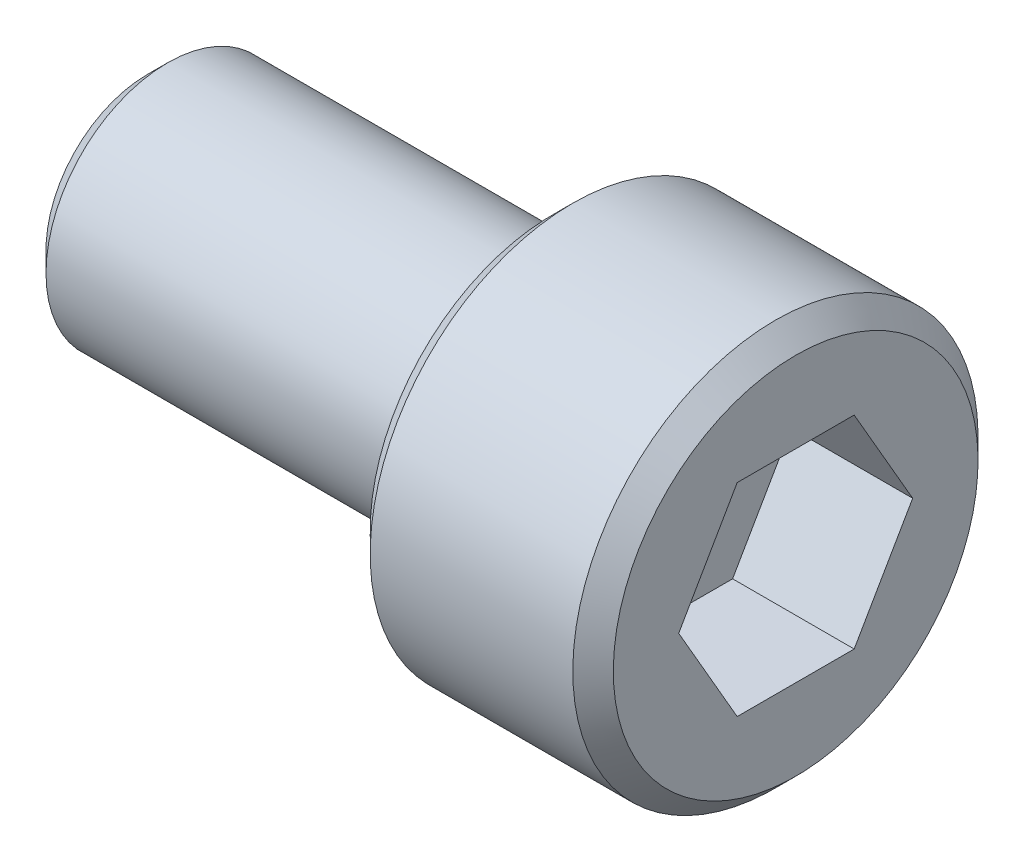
from build123d import *

# Parameters (mm, degrees)
ENL_V_MAT_EXTRU_1_DEPTH = 3
CHANFREIN2_SIZE         = 0.5


with BuildPart() as part:
    # Esquisse1 → R_volution1 (revolve)
    with BuildSketch(Plane.XY):
        Polygon((-16, 0), (-16, 3), (-6, 3), (-6, 5), (0, 5), (0, 0), align=None)
    revolve(axis=Axis((0, 0, 0), (-1, 0, 0)))

    # Esquisse2 → Enl_v. mat.-Extru.1 (cut)
    with BuildSketch(Plane(origin=(0, 0, 0), x_dir=(0, 0, -1), z_dir=(1, 0, 0))):
        Polygon((2.886751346, 0), (1.443375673, 2.5), (-1.443375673, 2.5), (-2.886751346, 0), (-1.443375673, -2.5), (1.443375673, -2.5), align=None)
    extrude(amount=-ENL_V_MAT_EXTRU_1_DEPTH, mode=Mode.SUBTRACT)

    # Chanfrein2
    chanfrein2_edges = [part.edges().sort_by_distance(p)[0] for p in [
        (0, -5, 0),
        (-6, -5, 0),
        (-16, -3, 0),
    ]]
    chamfer(chanfrein2_edges, length=CHANFREIN2_SIZE)


solid = part.part
